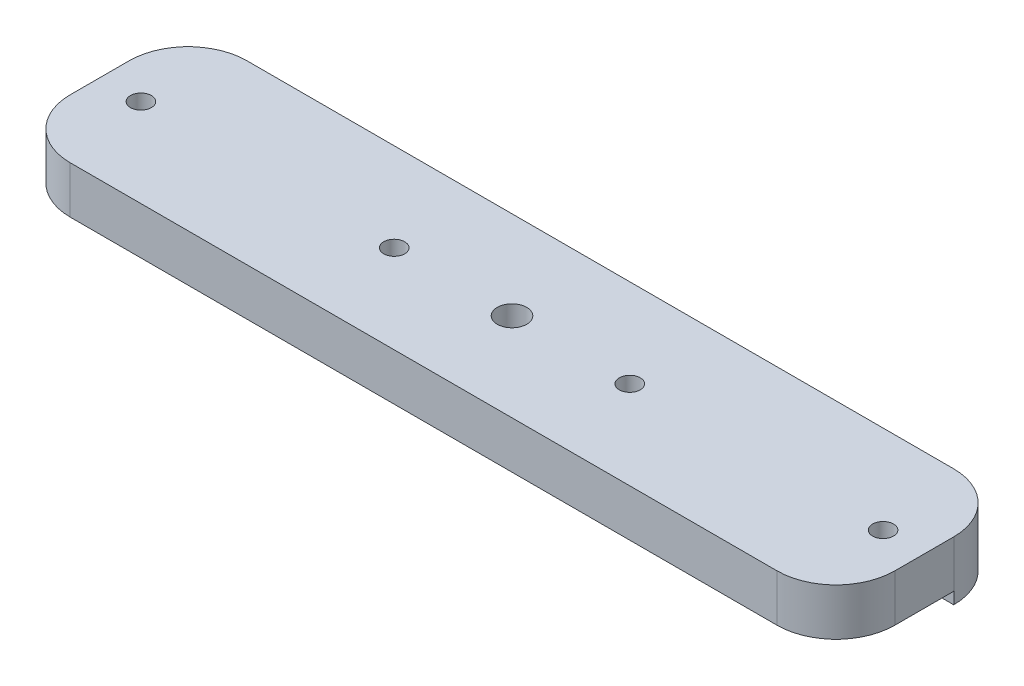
ISO-10303-21;
HEADER;
FILE_DESCRIPTION(('STEP AP214'),'2;1');
FILE_NAME('part.step','',(''),(''),'','','');
FILE_SCHEMA(('AUTOMOTIVE_DESIGN { 1 0 10303 214 1 1 1 1 }'));
ENDSEC;
DATA;
#1=APPLICATION_CONTEXT('core data for automotive mechanical design processes');
#2=APPLICATION_PROTOCOL_DEFINITION('international standard','automotive_design',2000,#1);
#3=PRODUCT_CONTEXT('',#1,'mechanical');
#4=PRODUCT('Part','Part','',(#3));
#5=PRODUCT_RELATED_PRODUCT_CATEGORY('part','',(#4));
#6=PRODUCT_DEFINITION_FORMATION('','',#4);
#7=PRODUCT_DEFINITION_CONTEXT('part definition',#1,'design');
#8=PRODUCT_DEFINITION('design','',#6,#7);
#9=PRODUCT_DEFINITION_SHAPE('','',#8);
#10=(LENGTH_UNIT() NAMED_UNIT(*) SI_UNIT(.MILLI.,.METRE.));
#11=(NAMED_UNIT(*) PLANE_ANGLE_UNIT() SI_UNIT($,.RADIAN.));
#12=(NAMED_UNIT(*) SI_UNIT($,.STERADIAN.) SOLID_ANGLE_UNIT());
#13=UNCERTAINTY_MEASURE_WITH_UNIT(LENGTH_MEASURE(1.E-05),#10,'distance_accuracy_value','');
#14=(GEOMETRIC_REPRESENTATION_CONTEXT(3) GLOBAL_UNCERTAINTY_ASSIGNED_CONTEXT((#13)) GLOBAL_UNIT_ASSIGNED_CONTEXT((#10,
#11,#12)) REPRESENTATION_CONTEXT('',''));
#15=CARTESIAN_POINT('',(0.,0.,0.));
#16=DIRECTION('',(0.,0.,1.));
#17=DIRECTION('',(1.,0.,0.));
#18=AXIS2_PLACEMENT_3D('',#15,#16,#17);
#19=CARTESIAN_POINT('',(44.45,6.35,9.525));
#20=DIRECTION('',(-1.,0.,0.));
#21=DIRECTION('',(0.,0.,1.));
#22=AXIS2_PLACEMENT_3D('',#19,#20,#21);
#23=PLANE('',#22);
#24=DIRECTION('',(0.,0.,1.));
#25=VECTOR('',#24,1.);
#26=CARTESIAN_POINT('',(44.45,1.27,3.175));
#27=LINE('',#26,#25);
#28=CARTESIAN_POINT('',(44.45,1.27,-3.175));
#29=VERTEX_POINT('',#28);
#30=CARTESIAN_POINT('',(44.45,1.27,3.175));
#31=VERTEX_POINT('',#30);
#32=EDGE_CURVE('E116',#29,#31,#27,.T.);
#33=ORIENTED_EDGE('',*,*,#32,.F.);
#34=DIRECTION('',(0.,-1.,0.));
#35=VECTOR('',#34,1.);
#36=CARTESIAN_POINT('',(44.45,6.35,-3.175));
#37=LINE('',#36,#35);
#38=CARTESIAN_POINT('',(44.45,6.35,-3.175));
#39=VERTEX_POINT('',#38);
#40=EDGE_CURVE('E168',#29,#39,#37,.F.);
#41=ORIENTED_EDGE('',*,*,#40,.T.);
#42=DIRECTION('',(0.,0.,-1.));
#43=VECTOR('',#42,1.);
#44=CARTESIAN_POINT('',(44.45,6.35,9.525));
#45=LINE('',#44,#43);
#46=CARTESIAN_POINT('',(44.45,6.35,3.175));
#47=VERTEX_POINT('',#46);
#48=EDGE_CURVE('E205',#47,#39,#45,.T.);
#49=ORIENTED_EDGE('',*,*,#48,.F.);
#50=DIRECTION('',(0.,-1.,0.));
#51=VECTOR('',#50,1.);
#52=CARTESIAN_POINT('',(44.45,6.35,3.175));
#53=LINE('',#52,#51);
#54=EDGE_CURVE('E165',#47,#31,#53,.T.);
#55=ORIENTED_EDGE('',*,*,#54,.T.);
#56=EDGE_LOOP('',(#33,#41,#49,#55));
#57=FACE_BOUND('',#56,.T.);
#58=ADVANCED_FACE('F37',(#57),#23,.F.);
#59=CARTESIAN_POINT('',(-44.45,6.35,9.525));
#60=DIRECTION('',(1.,0.,0.));
#61=DIRECTION('',(0.,0.,-1.));
#62=AXIS2_PLACEMENT_3D('',#59,#60,#61);
#63=PLANE('',#62);
#64=DIRECTION('',(0.,0.,-1.));
#65=VECTOR('',#64,1.);
#66=CARTESIAN_POINT('',(-44.45,1.27,-3.175));
#67=LINE('',#66,#65);
#68=CARTESIAN_POINT('',(-44.45,1.27,3.175));
#69=VERTEX_POINT('',#68);
#70=CARTESIAN_POINT('',(-44.45,1.27,-3.175));
#71=VERTEX_POINT('',#70);
#72=EDGE_CURVE('E117',#69,#71,#67,.T.);
#73=ORIENTED_EDGE('',*,*,#72,.F.);
#74=DIRECTION('',(0.,-1.,0.));
#75=VECTOR('',#74,1.);
#76=CARTESIAN_POINT('',(-44.45,6.35,3.175));
#77=LINE('',#76,#75);
#78=CARTESIAN_POINT('',(-44.45,6.35,3.175));
#79=VERTEX_POINT('',#78);
#80=EDGE_CURVE('E143',#69,#79,#77,.F.);
#81=ORIENTED_EDGE('',*,*,#80,.T.);
#82=DIRECTION('',(0.,0.,1.));
#83=VECTOR('',#82,1.);
#84=CARTESIAN_POINT('',(-44.45,6.35,9.525));
#85=LINE('',#84,#83);
#86=CARTESIAN_POINT('',(-44.45,6.35,-3.175));
#87=VERTEX_POINT('',#86);
#88=EDGE_CURVE('E141',#87,#79,#85,.T.);
#89=ORIENTED_EDGE('',*,*,#88,.F.);
#90=DIRECTION('',(0.,-1.,0.));
#91=VECTOR('',#90,1.);
#92=CARTESIAN_POINT('',(-44.45,6.35,-3.175));
#93=LINE('',#92,#91);
#94=EDGE_CURVE('E133',#87,#71,#93,.T.);
#95=ORIENTED_EDGE('',*,*,#94,.T.);
#96=EDGE_LOOP('',(#73,#81,#89,#95));
#97=FACE_BOUND('',#96,.T.);
#98=ADVANCED_FACE('F139',(#97),#63,.F.);
#99=CARTESIAN_POINT('',(-44.45,6.35,9.525));
#100=DIRECTION('',(0.,0.,-1.));
#101=DIRECTION('',(-1.,0.,0.));
#102=AXIS2_PLACEMENT_3D('',#99,#100,#101);
#103=PLANE('',#102);
#104=DIRECTION('',(-1.,0.,0.));
#105=VECTOR('',#104,1.);
#106=CARTESIAN_POINT('',(-38.1,1.27,9.525));
#107=LINE('',#106,#105);
#108=CARTESIAN_POINT('',(38.1,1.27,9.525));
#109=VERTEX_POINT('',#108);
#110=CARTESIAN_POINT('',(-38.1,1.27,9.525));
#111=VERTEX_POINT('',#110);
#112=EDGE_CURVE('E53',#109,#111,#107,.T.);
#113=ORIENTED_EDGE('',*,*,#112,.F.);
#114=DIRECTION('',(0.,-1.,0.));
#115=VECTOR('',#114,1.);
#116=CARTESIAN_POINT('',(38.1,6.35,9.525));
#117=LINE('',#116,#115);
#118=CARTESIAN_POINT('',(38.1,6.35,9.525));
#119=VERTEX_POINT('',#118);
#120=EDGE_CURVE('E11',#109,#119,#117,.F.);
#121=ORIENTED_EDGE('',*,*,#120,.T.);
#122=DIRECTION('',(1.,0.,0.));
#123=VECTOR('',#122,1.);
#124=CARTESIAN_POINT('',(-44.45,6.35,9.525));
#125=LINE('',#124,#123);
#126=CARTESIAN_POINT('',(-38.1,6.35,9.525));
#127=VERTEX_POINT('',#126);
#128=EDGE_CURVE('E147',#127,#119,#125,.T.);
#129=ORIENTED_EDGE('',*,*,#128,.F.);
#130=DIRECTION('',(0.,-1.,0.));
#131=VECTOR('',#130,1.);
#132=CARTESIAN_POINT('',(-38.1,6.35,9.525));
#133=LINE('',#132,#131);
#134=EDGE_CURVE('E46',#127,#111,#133,.T.);
#135=ORIENTED_EDGE('',*,*,#134,.T.);
#136=EDGE_LOOP('',(#113,#121,#129,#135));
#137=FACE_BOUND('',#136,.T.);
#138=ADVANCED_FACE('F172',(#137),#103,.F.);
#139=CARTESIAN_POINT('',(12.7,6.35,0.));
#140=DIRECTION('',(0.,1.,0.));
#141=DIRECTION('',(0.,0.,1.));
#142=AXIS2_PLACEMENT_3D('',#139,#140,#141);
#143=CYLINDRICAL_SURFACE('',#142,1.1303);
#144=CARTESIAN_POINT('',(12.7,6.35,0.));
#145=DIRECTION('',(0.,1.,0.));
#146=DIRECTION('',(0.,0.,1.));
#147=AXIS2_PLACEMENT_3D('',#144,#145,#146);
#148=CIRCLE('',#147,1.1303);
#149=CARTESIAN_POINT('',(12.7,6.35,1.13029999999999));
#150=VERTEX_POINT('',#149);
#151=EDGE_CURVE('E201',#150,#150,#148,.T.);
#152=ORIENTED_EDGE('',*,*,#151,.T.);
#153=EDGE_LOOP('',(#152));
#154=FACE_BOUND('',#153,.T.);
#155=CARTESIAN_POINT('',(12.7,1.27,0.));
#156=DIRECTION('',(0.,-1.,0.));
#157=DIRECTION('',(0.,0.,-1.));
#158=AXIS2_PLACEMENT_3D('',#155,#156,#157);
#159=CIRCLE('',#158,1.1303);
#160=CARTESIAN_POINT('',(12.7,1.27,-1.1303));
#161=VERTEX_POINT('',#160);
#162=EDGE_CURVE('E189',#161,#161,#159,.F.);
#163=ORIENTED_EDGE('',*,*,#162,.F.);
#164=EDGE_LOOP('',(#163));
#165=FACE_BOUND('',#164,.T.);
#166=ADVANCED_FACE('F282',(#154,#165),#143,.F.);
#167=CARTESIAN_POINT('',(-12.7,6.35,0.));
#168=DIRECTION('',(0.,1.,0.));
#169=DIRECTION('',(0.,0.,1.));
#170=AXIS2_PLACEMENT_3D('',#167,#168,#169);
#171=CYLINDRICAL_SURFACE('',#170,1.1303);
#172=CARTESIAN_POINT('',(-12.7,6.35,0.));
#173=DIRECTION('',(0.,1.,0.));
#174=DIRECTION('',(0.,0.,1.));
#175=AXIS2_PLACEMENT_3D('',#172,#173,#174);
#176=CIRCLE('',#175,1.1303);
#177=CARTESIAN_POINT('',(-12.7,6.35,1.1303));
#178=VERTEX_POINT('',#177);
#179=EDGE_CURVE('E198',#178,#178,#176,.T.);
#180=ORIENTED_EDGE('',*,*,#179,.T.);
#181=EDGE_LOOP('',(#180));
#182=FACE_BOUND('',#181,.T.);
#183=CARTESIAN_POINT('',(-12.7,1.27,0.));
#184=DIRECTION('',(0.,-1.,0.));
#185=DIRECTION('',(0.,0.,-1.));
#186=AXIS2_PLACEMENT_3D('',#183,#184,#185);
#187=CIRCLE('',#186,1.1303);
#188=CARTESIAN_POINT('',(-12.7,1.27,-1.1303));
#189=VERTEX_POINT('',#188);
#190=EDGE_CURVE('E186',#189,#189,#187,.F.);
#191=ORIENTED_EDGE('',*,*,#190,.F.);
#192=EDGE_LOOP('',(#191));
#193=FACE_BOUND('',#192,.T.);
#194=ADVANCED_FACE('F280',(#182,#193),#171,.F.);
#195=CARTESIAN_POINT('',(40.005,6.35,0.));
#196=DIRECTION('',(0.,1.,0.));
#197=DIRECTION('',(0.,0.,1.));
#198=AXIS2_PLACEMENT_3D('',#195,#196,#197);
#199=CYLINDRICAL_SURFACE('',#198,1.1303);
#200=CARTESIAN_POINT('',(40.005,6.35,0.));
#201=DIRECTION('',(0.,1.,0.));
#202=DIRECTION('',(0.,0.,1.));
#203=AXIS2_PLACEMENT_3D('',#200,#201,#202);
#204=CIRCLE('',#203,1.1303);
#205=CARTESIAN_POINT('',(40.005,6.35,1.1303));
#206=VERTEX_POINT('',#205);
#207=EDGE_CURVE('E195',#206,#206,#204,.T.);
#208=ORIENTED_EDGE('',*,*,#207,.T.);
#209=EDGE_LOOP('',(#208));
#210=FACE_BOUND('',#209,.T.);
#211=CARTESIAN_POINT('',(40.005,1.27,0.));
#212=DIRECTION('',(0.,-1.,0.));
#213=DIRECTION('',(0.,0.,-1.));
#214=AXIS2_PLACEMENT_3D('',#211,#212,#213);
#215=CIRCLE('',#214,1.1303);
#216=CARTESIAN_POINT('',(40.005,1.27,-1.1303));
#217=VERTEX_POINT('',#216);
#218=EDGE_CURVE('E183',#217,#217,#215,.F.);
#219=ORIENTED_EDGE('',*,*,#218,.F.);
#220=EDGE_LOOP('',(#219));
#221=FACE_BOUND('',#220,.T.);
#222=ADVANCED_FACE('F254',(#210,#221),#199,.F.);
#223=CARTESIAN_POINT('',(-40.005,6.35,0.));
#224=DIRECTION('',(0.,1.,0.));
#225=DIRECTION('',(0.,0.,1.));
#226=AXIS2_PLACEMENT_3D('',#223,#224,#225);
#227=CYLINDRICAL_SURFACE('',#226,1.1303);
#228=CARTESIAN_POINT('',(-40.005,6.35,0.));
#229=DIRECTION('',(0.,1.,0.));
#230=DIRECTION('',(0.,0.,1.));
#231=AXIS2_PLACEMENT_3D('',#228,#229,#230);
#232=CIRCLE('',#231,1.1303);
#233=CARTESIAN_POINT('',(-40.005,6.35,1.1303));
#234=VERTEX_POINT('',#233);
#235=EDGE_CURVE('E192',#234,#234,#232,.T.);
#236=ORIENTED_EDGE('',*,*,#235,.T.);
#237=EDGE_LOOP('',(#236));
#238=FACE_BOUND('',#237,.T.);
#239=CARTESIAN_POINT('',(-40.005,1.27,0.));
#240=DIRECTION('',(0.,-1.,0.));
#241=DIRECTION('',(0.,0.,-1.));
#242=AXIS2_PLACEMENT_3D('',#239,#240,#241);
#243=CIRCLE('',#242,1.1303);
#244=CARTESIAN_POINT('',(-40.005,1.27,-1.1303));
#245=VERTEX_POINT('',#244);
#246=EDGE_CURVE('E136',#245,#245,#243,.F.);
#247=ORIENTED_EDGE('',*,*,#246,.F.);
#248=EDGE_LOOP('',(#247));
#249=FACE_BOUND('',#248,.T.);
#250=ADVANCED_FACE('F248',(#238,#249),#227,.F.);
#251=CARTESIAN_POINT('',(38.1,6.35,3.175));
#252=DIRECTION('',(0.,-1.,0.));
#253=DIRECTION('',(0.,0.,-1.));
#254=AXIS2_PLACEMENT_3D('',#251,#252,#253);
#255=CYLINDRICAL_SURFACE('',#254,6.35);
#256=ORIENTED_EDGE('',*,*,#120,.F.);
#257=CARTESIAN_POINT('',(38.1,1.27,3.175));
#258=DIRECTION('',(0.,-1.,0.));
#259=DIRECTION('',(0.,0.,-1.));
#260=AXIS2_PLACEMENT_3D('',#257,#258,#259);
#261=CIRCLE('',#260,6.35);
#262=EDGE_CURVE('E176',#31,#109,#261,.T.);
#263=ORIENTED_EDGE('',*,*,#262,.F.);
#264=ORIENTED_EDGE('',*,*,#54,.F.);
#265=CARTESIAN_POINT('',(38.1,6.35,3.175));
#266=DIRECTION('',(0.,-1.,0.));
#267=DIRECTION('',(0.,0.,-1.));
#268=AXIS2_PLACEMENT_3D('',#265,#266,#267);
#269=CIRCLE('',#268,6.35);
#270=EDGE_CURVE('E159',#119,#47,#269,.F.);
#271=ORIENTED_EDGE('',*,*,#270,.F.);
#272=EDGE_LOOP('',(#256,#263,#264,#271));
#273=FACE_BOUND('',#272,.T.);
#274=ADVANCED_FACE('F246',(#273),#255,.T.);
#275=CARTESIAN_POINT('',(-38.1,6.35,3.175));
#276=DIRECTION('',(0.,-1.,0.));
#277=DIRECTION('',(0.,0.,-1.));
#278=AXIS2_PLACEMENT_3D('',#275,#276,#277);
#279=CYLINDRICAL_SURFACE('',#278,6.35);
#280=ORIENTED_EDGE('',*,*,#80,.F.);
#281=CARTESIAN_POINT('',(-38.1,1.27,3.175));
#282=DIRECTION('',(0.,-1.,0.));
#283=DIRECTION('',(0.,0.,-1.));
#284=AXIS2_PLACEMENT_3D('',#281,#282,#283);
#285=CIRCLE('',#284,6.35);
#286=EDGE_CURVE('E122',#111,#69,#285,.T.);
#287=ORIENTED_EDGE('',*,*,#286,.F.);
#288=ORIENTED_EDGE('',*,*,#134,.F.);
#289=CARTESIAN_POINT('',(-38.1,6.35,3.175));
#290=DIRECTION('',(0.,-1.,0.));
#291=DIRECTION('',(0.,0.,-1.));
#292=AXIS2_PLACEMENT_3D('',#289,#290,#291);
#293=CIRCLE('',#292,6.35);
#294=EDGE_CURVE('E157',#79,#127,#293,.F.);
#295=ORIENTED_EDGE('',*,*,#294,.F.);
#296=EDGE_LOOP('',(#280,#287,#288,#295));
#297=FACE_BOUND('',#296,.T.);
#298=ADVANCED_FACE('F39',(#297),#279,.T.);
#299=CARTESIAN_POINT('',(-44.45,6.35,-9.525));
#300=DIRECTION('',(0.,0.,1.));
#301=DIRECTION('',(1.,0.,0.));
#302=AXIS2_PLACEMENT_3D('',#299,#300,#301);
#303=PLANE('',#302);
#304=DIRECTION('',(-1.,0.,0.));
#305=VECTOR('',#304,1.);
#306=CARTESIAN_POINT('',(-44.45,0.,-9.525));
#307=LINE('',#306,#305);
#308=CARTESIAN_POINT('',(38.1,0.,-9.525));
#309=VERTEX_POINT('',#308);
#310=CARTESIAN_POINT('',(-38.1,0.,-9.525));
#311=VERTEX_POINT('',#310);
#312=EDGE_CURVE('E204',#309,#311,#307,.T.);
#313=ORIENTED_EDGE('',*,*,#312,.T.);
#314=DIRECTION('',(0.,-1.,0.));
#315=VECTOR('',#314,1.);
#316=CARTESIAN_POINT('',(-38.1,6.35,-9.525));
#317=LINE('',#316,#315);
#318=CARTESIAN_POINT('',(-38.1,6.35,-9.525));
#319=VERTEX_POINT('',#318);
#320=EDGE_CURVE('E155',#311,#319,#317,.F.);
#321=ORIENTED_EDGE('',*,*,#320,.T.);
#322=DIRECTION('',(-1.,0.,0.));
#323=VECTOR('',#322,1.);
#324=CARTESIAN_POINT('',(-44.45,6.35,-9.525));
#325=LINE('',#324,#323);
#326=CARTESIAN_POINT('',(38.1,6.35,-9.525));
#327=VERTEX_POINT('',#326);
#328=EDGE_CURVE('E208',#327,#319,#325,.T.);
#329=ORIENTED_EDGE('',*,*,#328,.F.);
#330=DIRECTION('',(0.,-1.,0.));
#331=VECTOR('',#330,1.);
#332=CARTESIAN_POINT('',(38.1,6.35,-9.525));
#333=LINE('',#332,#331);
#334=EDGE_CURVE('E152',#327,#309,#333,.T.);
#335=ORIENTED_EDGE('',*,*,#334,.T.);
#336=EDGE_LOOP('',(#313,#321,#329,#335));
#337=FACE_BOUND('',#336,.T.);
#338=ADVANCED_FACE('F215',(#337),#303,.F.);
#339=CARTESIAN_POINT('',(44.45,6.35,-9.525));
#340=DIRECTION('',(0.,-1.,0.));
#341=DIRECTION('',(0.,0.,-1.));
#342=AXIS2_PLACEMENT_3D('',#339,#340,#341);
#343=PLANE('',#342);
#344=CARTESIAN_POINT('',(0.,6.35,0.));
#345=DIRECTION('',(0.,1.,0.));
#346=DIRECTION('',(0.,0.,1.));
#347=AXIS2_PLACEMENT_3D('',#344,#345,#346);
#348=CIRCLE('',#347,1.5875);
#349=CARTESIAN_POINT('',(0.,6.35,1.5875));
#350=VERTEX_POINT('',#349);
#351=EDGE_CURVE('E263',#350,#350,#348,.T.);
#352=ORIENTED_EDGE('',*,*,#351,.F.);
#353=EDGE_LOOP('',(#352));
#354=FACE_BOUND('',#353,.T.);
#355=ORIENTED_EDGE('',*,*,#235,.F.);
#356=EDGE_LOOP('',(#355));
#357=FACE_BOUND('',#356,.T.);
#358=ORIENTED_EDGE('',*,*,#207,.F.);
#359=EDGE_LOOP('',(#358));
#360=FACE_BOUND('',#359,.T.);
#361=ORIENTED_EDGE('',*,*,#179,.F.);
#362=EDGE_LOOP('',(#361));
#363=FACE_BOUND('',#362,.T.);
#364=ORIENTED_EDGE('',*,*,#151,.F.);
#365=EDGE_LOOP('',(#364));
#366=FACE_BOUND('',#365,.T.);
#367=ORIENTED_EDGE('',*,*,#328,.T.);
#368=CARTESIAN_POINT('',(-38.1,6.35,-3.175));
#369=DIRECTION('',(0.,-1.,0.));
#370=DIRECTION('',(0.,0.,-1.));
#371=AXIS2_PLACEMENT_3D('',#368,#369,#370);
#372=CIRCLE('',#371,6.35);
#373=EDGE_CURVE('E163',#319,#87,#372,.F.);
#374=ORIENTED_EDGE('',*,*,#373,.T.);
#375=ORIENTED_EDGE('',*,*,#88,.T.);
#376=ORIENTED_EDGE('',*,*,#294,.T.);
#377=ORIENTED_EDGE('',*,*,#128,.T.);
#378=ORIENTED_EDGE('',*,*,#270,.T.);
#379=ORIENTED_EDGE('',*,*,#48,.T.);
#380=CARTESIAN_POINT('',(38.1,6.35,-3.175));
#381=DIRECTION('',(0.,-1.,0.));
#382=DIRECTION('',(0.,0.,-1.));
#383=AXIS2_PLACEMENT_3D('',#380,#381,#382);
#384=CIRCLE('',#383,6.35);
#385=EDGE_CURVE('E161',#39,#327,#384,.F.);
#386=ORIENTED_EDGE('',*,*,#385,.T.);
#387=EDGE_LOOP('',(#367,#374,#375,#376,#377,#378,#379,#386));
#388=FACE_BOUND('',#387,.T.);
#389=ADVANCED_FACE('F220',(#354,#357,#360,#363,#366,#388),#343,.F.);
#390=CARTESIAN_POINT('',(44.45,0.,-9.525));
#391=DIRECTION('',(0.,-1.,0.));
#392=DIRECTION('',(0.,0.,-1.));
#393=AXIS2_PLACEMENT_3D('',#390,#391,#392);
#394=PLANE('',#393);
#395=DIRECTION('',(1.,0.,0.));
#396=VECTOR('',#395,1.);
#397=CARTESIAN_POINT('',(-44.45,0.,-3.175));
#398=LINE('',#397,#396);
#399=CARTESIAN_POINT('',(-44.45,0.,-3.175));
#400=VERTEX_POINT('',#399);
#401=CARTESIAN_POINT('',(44.45,0.,-3.175));
#402=VERTEX_POINT('',#401);
#403=EDGE_CURVE('E126',#400,#402,#398,.T.);
#404=ORIENTED_EDGE('',*,*,#403,.F.);
#405=CARTESIAN_POINT('',(-38.1,0.,-3.175));
#406=DIRECTION('',(0.,-1.,0.));
#407=DIRECTION('',(0.,0.,-1.));
#408=AXIS2_PLACEMENT_3D('',#405,#406,#407);
#409=CIRCLE('',#408,6.35);
#410=EDGE_CURVE('E135',#400,#311,#409,.T.);
#411=ORIENTED_EDGE('',*,*,#410,.T.);
#412=ORIENTED_EDGE('',*,*,#312,.F.);
#413=CARTESIAN_POINT('',(38.1,0.,-3.175));
#414=DIRECTION('',(0.,-1.,0.));
#415=DIRECTION('',(0.,0.,-1.));
#416=AXIS2_PLACEMENT_3D('',#413,#414,#415);
#417=CIRCLE('',#416,6.35);
#418=EDGE_CURVE('E142',#309,#402,#417,.T.);
#419=ORIENTED_EDGE('',*,*,#418,.T.);
#420=EDGE_LOOP('',(#404,#411,#412,#419));
#421=FACE_BOUND('',#420,.T.);
#422=ADVANCED_FACE('F225',(#421),#394,.T.);
#423=CARTESIAN_POINT('',(-38.1,6.35,-3.175));
#424=DIRECTION('',(0.,-1.,0.));
#425=DIRECTION('',(0.,0.,-1.));
#426=AXIS2_PLACEMENT_3D('',#423,#424,#425);
#427=CYLINDRICAL_SURFACE('',#426,6.35);
#428=ORIENTED_EDGE('',*,*,#373,.F.);
#429=ORIENTED_EDGE('',*,*,#320,.F.);
#430=ORIENTED_EDGE('',*,*,#410,.F.);
#431=DIRECTION('',(0.,-1.,0.));
#432=VECTOR('',#431,1.);
#433=CARTESIAN_POINT('',(-44.45,1.27,-3.175));
#434=LINE('',#433,#432);
#435=EDGE_CURVE('E111',#71,#400,#434,.T.);
#436=ORIENTED_EDGE('',*,*,#435,.F.);
#437=ORIENTED_EDGE('',*,*,#94,.F.);
#438=EDGE_LOOP('',(#428,#429,#430,#436,#437));
#439=FACE_BOUND('',#438,.T.);
#440=ADVANCED_FACE('F132',(#439),#427,.T.);
#441=CARTESIAN_POINT('',(38.1,6.35,-3.175));
#442=DIRECTION('',(0.,-1.,0.));
#443=DIRECTION('',(0.,0.,-1.));
#444=AXIS2_PLACEMENT_3D('',#441,#442,#443);
#445=CYLINDRICAL_SURFACE('',#444,6.35);
#446=ORIENTED_EDGE('',*,*,#385,.F.);
#447=ORIENTED_EDGE('',*,*,#40,.F.);
#448=EDGE_CURVE('E114',#402,#29,#37,.F.);
#449=ORIENTED_EDGE('',*,*,#448,.F.);
#450=ORIENTED_EDGE('',*,*,#418,.F.);
#451=ORIENTED_EDGE('',*,*,#334,.F.);
#452=EDGE_LOOP('',(#446,#447,#449,#450,#451));
#453=FACE_BOUND('',#452,.T.);
#454=ADVANCED_FACE('F223',(#453),#445,.T.);
#455=CARTESIAN_POINT('',(-38.1,1.27,3.175));
#456=DIRECTION('',(0.,-1.,0.));
#457=DIRECTION('',(0.,0.,-1.));
#458=AXIS2_PLACEMENT_3D('',#455,#456,#457);
#459=PLANE('',#458);
#460=CARTESIAN_POINT('',(0.,1.27,0.));
#461=DIRECTION('',(0.,-1.,0.));
#462=DIRECTION('',(0.,0.,-1.));
#463=AXIS2_PLACEMENT_3D('',#460,#461,#462);
#464=CIRCLE('',#463,1.5875);
#465=CARTESIAN_POINT('',(0.,1.27,-1.5875));
#466=VERTEX_POINT('',#465);
#467=EDGE_CURVE('E41',#466,#466,#464,.T.);
#468=ORIENTED_EDGE('',*,*,#467,.F.);
#469=EDGE_LOOP('',(#468));
#470=FACE_BOUND('',#469,.T.);
#471=ORIENTED_EDGE('',*,*,#190,.T.);
#472=EDGE_LOOP('',(#471));
#473=FACE_BOUND('',#472,.T.);
#474=ORIENTED_EDGE('',*,*,#246,.T.);
#475=EDGE_LOOP('',(#474));
#476=FACE_BOUND('',#475,.T.);
#477=ORIENTED_EDGE('',*,*,#72,.T.);
#478=DIRECTION('',(1.,0.,0.));
#479=VECTOR('',#478,1.);
#480=CARTESIAN_POINT('',(-44.45,1.27,-3.175));
#481=LINE('',#480,#479);
#482=EDGE_CURVE('E107',#71,#29,#481,.T.);
#483=ORIENTED_EDGE('',*,*,#482,.T.);
#484=ORIENTED_EDGE('',*,*,#32,.T.);
#485=ORIENTED_EDGE('',*,*,#262,.T.);
#486=ORIENTED_EDGE('',*,*,#112,.T.);
#487=ORIENTED_EDGE('',*,*,#286,.T.);
#488=EDGE_LOOP('',(#477,#483,#484,#485,#486,#487));
#489=FACE_BOUND('',#488,.T.);
#490=ORIENTED_EDGE('',*,*,#218,.T.);
#491=EDGE_LOOP('',(#490));
#492=FACE_BOUND('',#491,.T.);
#493=ORIENTED_EDGE('',*,*,#162,.T.);
#494=EDGE_LOOP('',(#493));
#495=FACE_BOUND('',#494,.T.);
#496=ADVANCED_FACE('F120',(#470,#473,#476,#489,#492,#495),#459,.T.);
#497=CARTESIAN_POINT('',(-44.45,1.27,-3.175));
#498=DIRECTION('',(0.,0.,-1.));
#499=DIRECTION('',(-1.,0.,0.));
#500=AXIS2_PLACEMENT_3D('',#497,#498,#499);
#501=PLANE('',#500);
#502=ORIENTED_EDGE('',*,*,#403,.T.);
#503=ORIENTED_EDGE('',*,*,#448,.T.);
#504=ORIENTED_EDGE('',*,*,#482,.F.);
#505=ORIENTED_EDGE('',*,*,#435,.T.);
#506=EDGE_LOOP('',(#502,#503,#504,#505));
#507=FACE_BOUND('',#506,.T.);
#508=ADVANCED_FACE('F109',(#507),#501,.F.);
#509=CARTESIAN_POINT('',(0.,6.35,0.));
#510=DIRECTION('',(0.,1.,0.));
#511=DIRECTION('',(0.,0.,1.));
#512=AXIS2_PLACEMENT_3D('',#509,#510,#511);
#513=CYLINDRICAL_SURFACE('',#512,1.5875);
#514=ORIENTED_EDGE('',*,*,#467,.T.);
#515=EDGE_LOOP('',(#514));
#516=FACE_BOUND('',#515,.T.);
#517=ORIENTED_EDGE('',*,*,#351,.T.);
#518=EDGE_LOOP('',(#517));
#519=FACE_BOUND('',#518,.T.);
#520=ADVANCED_FACE('F270',(#516,#519),#513,.F.);
#521=CLOSED_SHELL('',(#58,#98,#138,#166,#194,#222,#250,#274,#298,#338,#389,#422,#440,#454,#496,
#508,#520));
#522=MANIFOLD_SOLID_BREP('B2',#521);
#523=ADVANCED_BREP_SHAPE_REPRESENTATION('',(#18,#522),#14);
#524=SHAPE_DEFINITION_REPRESENTATION(#9,#523);
ENDSEC;
END-ISO-10303-21;
